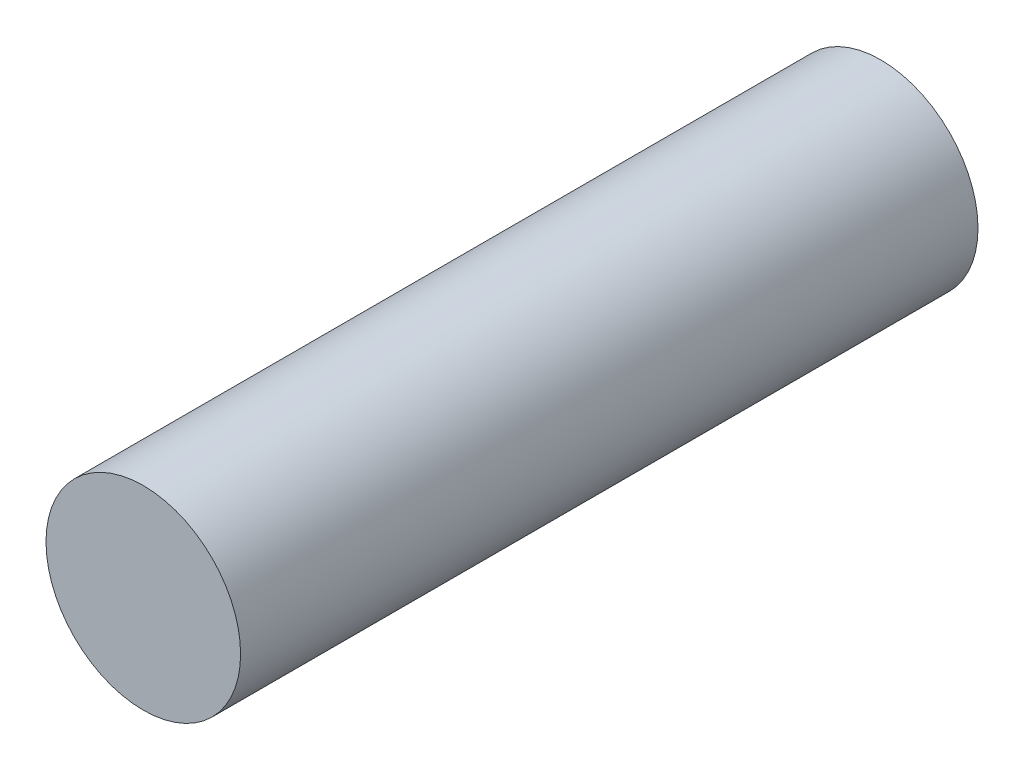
ISO-10303-21;
HEADER;
FILE_DESCRIPTION(('STEP AP214'),'2;1');
FILE_NAME('part.step','',(''),(''),'','','');
FILE_SCHEMA(('AUTOMOTIVE_DESIGN { 1 0 10303 214 1 1 1 1 }'));
ENDSEC;
DATA;
#1=APPLICATION_CONTEXT('core data for automotive mechanical design processes');
#2=APPLICATION_PROTOCOL_DEFINITION('international standard','automotive_design',2000,#1);
#3=PRODUCT_CONTEXT('',#1,'mechanical');
#4=PRODUCT('Part','Part','',(#3));
#5=PRODUCT_RELATED_PRODUCT_CATEGORY('part','',(#4));
#6=PRODUCT_DEFINITION_FORMATION('','',#4);
#7=PRODUCT_DEFINITION_CONTEXT('part definition',#1,'design');
#8=PRODUCT_DEFINITION('design','',#6,#7);
#9=PRODUCT_DEFINITION_SHAPE('','',#8);
#10=(LENGTH_UNIT() NAMED_UNIT(*) SI_UNIT(.MILLI.,.METRE.));
#11=(NAMED_UNIT(*) PLANE_ANGLE_UNIT() SI_UNIT($,.RADIAN.));
#12=(NAMED_UNIT(*) SI_UNIT($,.STERADIAN.) SOLID_ANGLE_UNIT());
#13=UNCERTAINTY_MEASURE_WITH_UNIT(LENGTH_MEASURE(1.E-05),#10,'distance_accuracy_value','');
#14=(GEOMETRIC_REPRESENTATION_CONTEXT(3) GLOBAL_UNCERTAINTY_ASSIGNED_CONTEXT((#13)) GLOBAL_UNIT_ASSIGNED_CONTEXT((#10,
#11,#12)) REPRESENTATION_CONTEXT('',''));
#15=CARTESIAN_POINT('',(0.,0.,0.));
#16=DIRECTION('',(0.,0.,1.));
#17=DIRECTION('',(1.,0.,0.));
#18=AXIS2_PLACEMENT_3D('',#15,#16,#17);
#19=CARTESIAN_POINT('',(0.,0.,36.));
#20=DIRECTION('',(0.,0.,-1.));
#21=DIRECTION('',(-1.,0.,0.));
#22=AXIS2_PLACEMENT_3D('',#19,#20,#21);
#23=CYLINDRICAL_SURFACE('',#22,9.5);
#24=CARTESIAN_POINT('',(0.,0.,36.));
#25=DIRECTION('',(0.,0.,1.));
#26=DIRECTION('',(1.,0.,0.));
#27=AXIS2_PLACEMENT_3D('',#24,#25,#26);
#28=CIRCLE('',#27,9.5);
#29=CARTESIAN_POINT('',(9.5,0.,36.));
#30=VERTEX_POINT('',#29);
#31=EDGE_CURVE('E10',#30,#30,#28,.T.);
#32=ORIENTED_EDGE('',*,*,#31,.F.);
#33=EDGE_LOOP('',(#32));
#34=FACE_BOUND('',#33,.T.);
#35=CARTESIAN_POINT('',(0.,0.,-36.));
#36=DIRECTION('',(0.,0.,1.));
#37=DIRECTION('',(1.,0.,0.));
#38=AXIS2_PLACEMENT_3D('',#35,#36,#37);
#39=CIRCLE('',#38,9.5);
#40=CARTESIAN_POINT('',(9.5,0.,-36.));
#41=VERTEX_POINT('',#40);
#42=EDGE_CURVE('E20',#41,#41,#39,.T.);
#43=ORIENTED_EDGE('',*,*,#42,.T.);
#44=EDGE_LOOP('',(#43));
#45=FACE_BOUND('',#44,.T.);
#46=ADVANCED_FACE('F14',(#34,#45),#23,.T.);
#47=CARTESIAN_POINT('',(0.,0.,36.));
#48=DIRECTION('',(0.,0.,1.));
#49=DIRECTION('',(1.,0.,0.));
#50=AXIS2_PLACEMENT_3D('',#47,#48,#49);
#51=PLANE('',#50);
#52=ORIENTED_EDGE('',*,*,#31,.T.);
#53=EDGE_LOOP('',(#52));
#54=FACE_BOUND('',#53,.T.);
#55=ADVANCED_FACE('F29',(#54),#51,.T.);
#56=CARTESIAN_POINT('',(0.,0.,-36.));
#57=DIRECTION('',(0.,0.,1.));
#58=DIRECTION('',(1.,0.,0.));
#59=AXIS2_PLACEMENT_3D('',#56,#57,#58);
#60=PLANE('',#59);
#61=ORIENTED_EDGE('',*,*,#42,.F.);
#62=EDGE_LOOP('',(#61));
#63=FACE_BOUND('',#62,.T.);
#64=ADVANCED_FACE('F27',(#63),#60,.F.);
#65=CLOSED_SHELL('',(#46,#55,#64));
#66=MANIFOLD_SOLID_BREP('B1',#65);
#67=ADVANCED_BREP_SHAPE_REPRESENTATION('',(#18,#66),#14);
#68=SHAPE_DEFINITION_REPRESENTATION(#9,#67);
ENDSEC;
END-ISO-10303-21;
